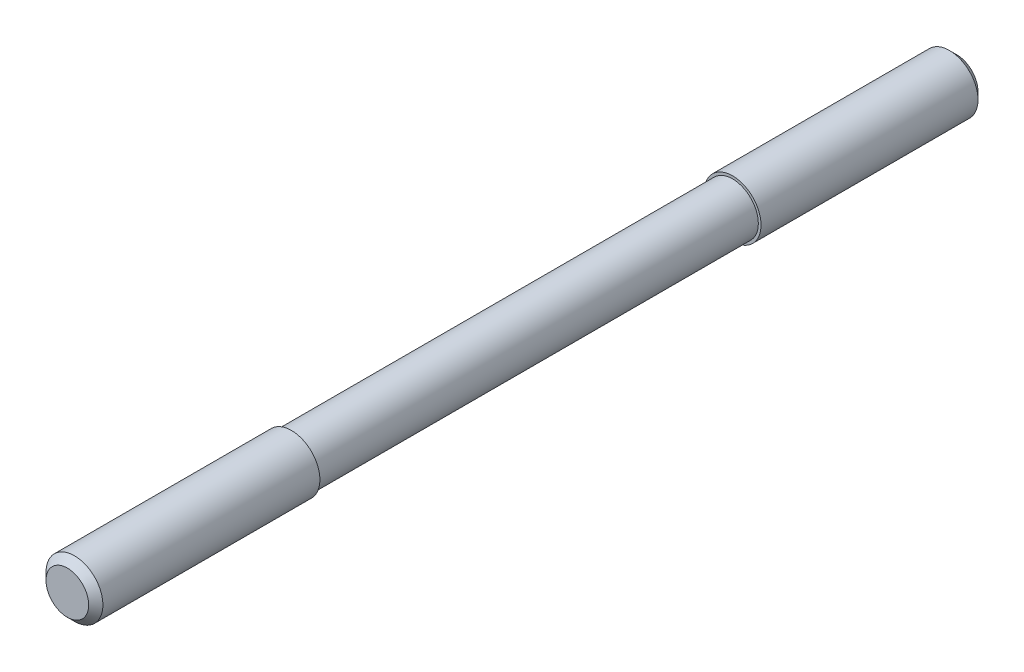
ISO-10303-21;
HEADER;
FILE_DESCRIPTION(('STEP AP214'),'2;1');
FILE_NAME('part.step','',(''),(''),'','','');
FILE_SCHEMA(('AUTOMOTIVE_DESIGN { 1 0 10303 214 1 1 1 1 }'));
ENDSEC;
DATA;
#1=APPLICATION_CONTEXT('core data for automotive mechanical design processes');
#2=APPLICATION_PROTOCOL_DEFINITION('international standard','automotive_design',2000,#1);
#3=PRODUCT_CONTEXT('',#1,'mechanical');
#4=PRODUCT('Part','Part','',(#3));
#5=PRODUCT_RELATED_PRODUCT_CATEGORY('part','',(#4));
#6=PRODUCT_DEFINITION_FORMATION('','',#4);
#7=PRODUCT_DEFINITION_CONTEXT('part definition',#1,'design');
#8=PRODUCT_DEFINITION('design','',#6,#7);
#9=PRODUCT_DEFINITION_SHAPE('','',#8);
#10=(LENGTH_UNIT() NAMED_UNIT(*) SI_UNIT(.MILLI.,.METRE.));
#11=(NAMED_UNIT(*) PLANE_ANGLE_UNIT() SI_UNIT($,.RADIAN.));
#12=(NAMED_UNIT(*) SI_UNIT($,.STERADIAN.) SOLID_ANGLE_UNIT());
#13=UNCERTAINTY_MEASURE_WITH_UNIT(LENGTH_MEASURE(1.E-05),#10,'distance_accuracy_value','');
#14=(GEOMETRIC_REPRESENTATION_CONTEXT(3) GLOBAL_UNCERTAINTY_ASSIGNED_CONTEXT((#13)) GLOBAL_UNIT_ASSIGNED_CONTEXT((#10,
#11,#12)) REPRESENTATION_CONTEXT('',''));
#15=CARTESIAN_POINT('',(0.,0.,0.));
#16=DIRECTION('',(0.,0.,1.));
#17=DIRECTION('',(1.,0.,0.));
#18=AXIS2_PLACEMENT_3D('',#15,#16,#17);
#19=CARTESIAN_POINT('',(0.,0.,0.));
#20=DIRECTION('',(0.,0.,1.));
#21=DIRECTION('',(1.,0.,0.));
#22=AXIS2_PLACEMENT_3D('',#19,#20,#21);
#23=PLANE('',#22);
#24=CARTESIAN_POINT('',(0.,0.,0.));
#25=DIRECTION('',(0.,0.,1.));
#26=DIRECTION('',(1.,0.,0.));
#27=AXIS2_PLACEMENT_3D('',#24,#25,#26);
#28=CIRCLE('',#27,6.);
#29=CARTESIAN_POINT('',(6.,0.,0.));
#30=VERTEX_POINT('',#29);
#31=EDGE_CURVE('E8',#30,#30,#28,.T.);
#32=ORIENTED_EDGE('',*,*,#31,.F.);
#33=EDGE_LOOP('',(#32));
#34=FACE_BOUND('',#33,.T.);
#35=ADVANCED_FACE('F12',(#34),#23,.F.);
#36=CARTESIAN_POINT('',(0.,0.,2.));
#37=DIRECTION('',(0.,0.,1.));
#38=DIRECTION('',(1.,0.,0.));
#39=AXIS2_PLACEMENT_3D('',#36,#37,#38);
#40=CONICAL_SURFACE('',#39,8.,0.785398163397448);
#41=ORIENTED_EDGE('',*,*,#31,.T.);
#42=EDGE_LOOP('',(#41));
#43=FACE_BOUND('',#42,.T.);
#44=CARTESIAN_POINT('',(0.,0.,2.));
#45=DIRECTION('',(0.,0.,1.));
#46=DIRECTION('',(1.,0.,0.));
#47=AXIS2_PLACEMENT_3D('',#44,#45,#46);
#48=CIRCLE('',#47,8.);
#49=CARTESIAN_POINT('',(8.,0.,2.));
#50=VERTEX_POINT('',#49);
#51=EDGE_CURVE('E18',#50,#50,#48,.T.);
#52=ORIENTED_EDGE('',*,*,#51,.F.);
#53=EDGE_LOOP('',(#52));
#54=FACE_BOUND('',#53,.T.);
#55=ADVANCED_FACE('F61',(#43,#54),#40,.T.);
#56=CARTESIAN_POINT('',(0.,0.,70.));
#57=DIRECTION('',(0.,0.,1.));
#58=DIRECTION('',(1.,0.,0.));
#59=AXIS2_PLACEMENT_3D('',#56,#57,#58);
#60=CYLINDRICAL_SURFACE('',#59,8.);
#61=CARTESIAN_POINT('',(0.,0.,63.));
#62=DIRECTION('',(0.,0.,1.));
#63=DIRECTION('',(1.,0.,0.));
#64=AXIS2_PLACEMENT_3D('',#61,#62,#63);
#65=CIRCLE('',#64,8.);
#66=CARTESIAN_POINT('',(8.,0.,63.));
#67=VERTEX_POINT('',#66);
#68=EDGE_CURVE('E22',#67,#67,#65,.T.);
#69=ORIENTED_EDGE('',*,*,#68,.F.);
#70=EDGE_LOOP('',(#69));
#71=FACE_BOUND('',#70,.T.);
#72=ORIENTED_EDGE('',*,*,#51,.T.);
#73=EDGE_LOOP('',(#72));
#74=FACE_BOUND('',#73,.T.);
#75=ADVANCED_FACE('F66',(#71,#74),#60,.T.);
#76=CARTESIAN_POINT('',(8.,0.,63.));
#77=DIRECTION('',(0.,0.,-1.));
#78=DIRECTION('',(-1.,0.,0.));
#79=AXIS2_PLACEMENT_3D('',#76,#77,#78);
#80=PLANE('',#79);
#81=CARTESIAN_POINT('',(0.,0.,63.));
#82=DIRECTION('',(0.,0.,1.));
#83=DIRECTION('',(1.,0.,0.));
#84=AXIS2_PLACEMENT_3D('',#81,#82,#83);
#85=CIRCLE('',#84,7.25);
#86=CARTESIAN_POINT('',(7.25,0.,63.));
#87=VERTEX_POINT('',#86);
#88=EDGE_CURVE('E26',#87,#87,#85,.T.);
#89=ORIENTED_EDGE('',*,*,#88,.F.);
#90=EDGE_LOOP('',(#89));
#91=FACE_BOUND('',#90,.T.);
#92=ORIENTED_EDGE('',*,*,#68,.T.);
#93=EDGE_LOOP('',(#92));
#94=FACE_BOUND('',#93,.T.);
#95=ADVANCED_FACE('F70',(#91,#94),#80,.F.);
#96=CARTESIAN_POINT('',(0.,0.,70.));
#97=DIRECTION('',(0.,0.,1.));
#98=DIRECTION('',(1.,0.,0.));
#99=AXIS2_PLACEMENT_3D('',#96,#97,#98);
#100=CYLINDRICAL_SURFACE('',#99,7.25);
#101=CARTESIAN_POINT('',(0.,0.,187.));
#102=DIRECTION('',(0.,0.,1.));
#103=DIRECTION('',(1.,0.,0.));
#104=AXIS2_PLACEMENT_3D('',#101,#102,#103);
#105=CIRCLE('',#104,7.25);
#106=CARTESIAN_POINT('',(7.25,0.,187.));
#107=VERTEX_POINT('',#106);
#108=EDGE_CURVE('E31',#107,#107,#105,.T.);
#109=ORIENTED_EDGE('',*,*,#108,.F.);
#110=EDGE_LOOP('',(#109));
#111=FACE_BOUND('',#110,.T.);
#112=ORIENTED_EDGE('',*,*,#88,.T.);
#113=EDGE_LOOP('',(#112));
#114=FACE_BOUND('',#113,.T.);
#115=ADVANCED_FACE('F77',(#111,#114),#100,.T.);
#116=CARTESIAN_POINT('',(7.25,0.,187.));
#117=DIRECTION('',(0.,0.,1.));
#118=DIRECTION('',(1.,0.,0.));
#119=AXIS2_PLACEMENT_3D('',#116,#117,#118);
#120=PLANE('',#119);
#121=CARTESIAN_POINT('',(0.,0.,187.));
#122=DIRECTION('',(0.,0.,1.));
#123=DIRECTION('',(1.,0.,0.));
#124=AXIS2_PLACEMENT_3D('',#121,#122,#123);
#125=CIRCLE('',#124,8.);
#126=CARTESIAN_POINT('',(8.,0.,187.));
#127=VERTEX_POINT('',#126);
#128=EDGE_CURVE('E34',#127,#127,#125,.T.);
#129=ORIENTED_EDGE('',*,*,#128,.F.);
#130=EDGE_LOOP('',(#129));
#131=FACE_BOUND('',#130,.T.);
#132=ORIENTED_EDGE('',*,*,#108,.T.);
#133=EDGE_LOOP('',(#132));
#134=FACE_BOUND('',#133,.T.);
#135=ADVANCED_FACE('F57',(#131,#134),#120,.F.);
#136=CARTESIAN_POINT('',(0.,0.,70.));
#137=DIRECTION('',(0.,0.,1.));
#138=DIRECTION('',(1.,0.,0.));
#139=AXIS2_PLACEMENT_3D('',#136,#137,#138);
#140=CYLINDRICAL_SURFACE('',#139,8.);
#141=CARTESIAN_POINT('',(0.,0.,248.));
#142=DIRECTION('',(0.,0.,1.));
#143=DIRECTION('',(1.,0.,0.));
#144=AXIS2_PLACEMENT_3D('',#141,#142,#143);
#145=CIRCLE('',#144,8.);
#146=CARTESIAN_POINT('',(8.,0.,248.));
#147=VERTEX_POINT('',#146);
#148=EDGE_CURVE('E37',#147,#147,#145,.T.);
#149=ORIENTED_EDGE('',*,*,#148,.F.);
#150=EDGE_LOOP('',(#149));
#151=FACE_BOUND('',#150,.T.);
#152=ORIENTED_EDGE('',*,*,#128,.T.);
#153=EDGE_LOOP('',(#152));
#154=FACE_BOUND('',#153,.T.);
#155=ADVANCED_FACE('F48',(#151,#154),#140,.T.);
#156=CARTESIAN_POINT('',(0.,0.,250.));
#157=DIRECTION('',(0.,0.,-1.));
#158=DIRECTION('',(-1.,0.,0.));
#159=AXIS2_PLACEMENT_3D('',#156,#157,#158);
#160=CONICAL_SURFACE('',#159,6.,0.785398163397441);
#161=ORIENTED_EDGE('',*,*,#148,.T.);
#162=EDGE_LOOP('',(#161));
#163=FACE_BOUND('',#162,.T.);
#164=CARTESIAN_POINT('',(0.,0.,250.));
#165=DIRECTION('',(0.,0.,1.));
#166=DIRECTION('',(1.,0.,0.));
#167=AXIS2_PLACEMENT_3D('',#164,#165,#166);
#168=CIRCLE('',#167,6.);
#169=CARTESIAN_POINT('',(6.,0.,250.));
#170=VERTEX_POINT('',#169);
#171=EDGE_CURVE('E40',#170,#170,#168,.T.);
#172=ORIENTED_EDGE('',*,*,#171,.F.);
#173=EDGE_LOOP('',(#172));
#174=FACE_BOUND('',#173,.T.);
#175=ADVANCED_FACE('F46',(#163,#174),#160,.T.);
#176=CARTESIAN_POINT('',(6.,0.,250.));
#177=DIRECTION('',(0.,0.,-1.));
#178=DIRECTION('',(-1.,0.,0.));
#179=AXIS2_PLACEMENT_3D('',#176,#177,#178);
#180=PLANE('',#179);
#181=ORIENTED_EDGE('',*,*,#171,.T.);
#182=EDGE_LOOP('',(#181));
#183=FACE_BOUND('',#182,.T.);
#184=ADVANCED_FACE('F44',(#183),#180,.F.);
#185=CLOSED_SHELL('',(#35,#55,#75,#95,#115,#135,#155,#175,#184));
#186=MANIFOLD_SOLID_BREP('B1',#185);
#187=ADVANCED_BREP_SHAPE_REPRESENTATION('',(#18,#186),#14);
#188=SHAPE_DEFINITION_REPRESENTATION(#9,#187);
ENDSEC;
END-ISO-10303-21;
